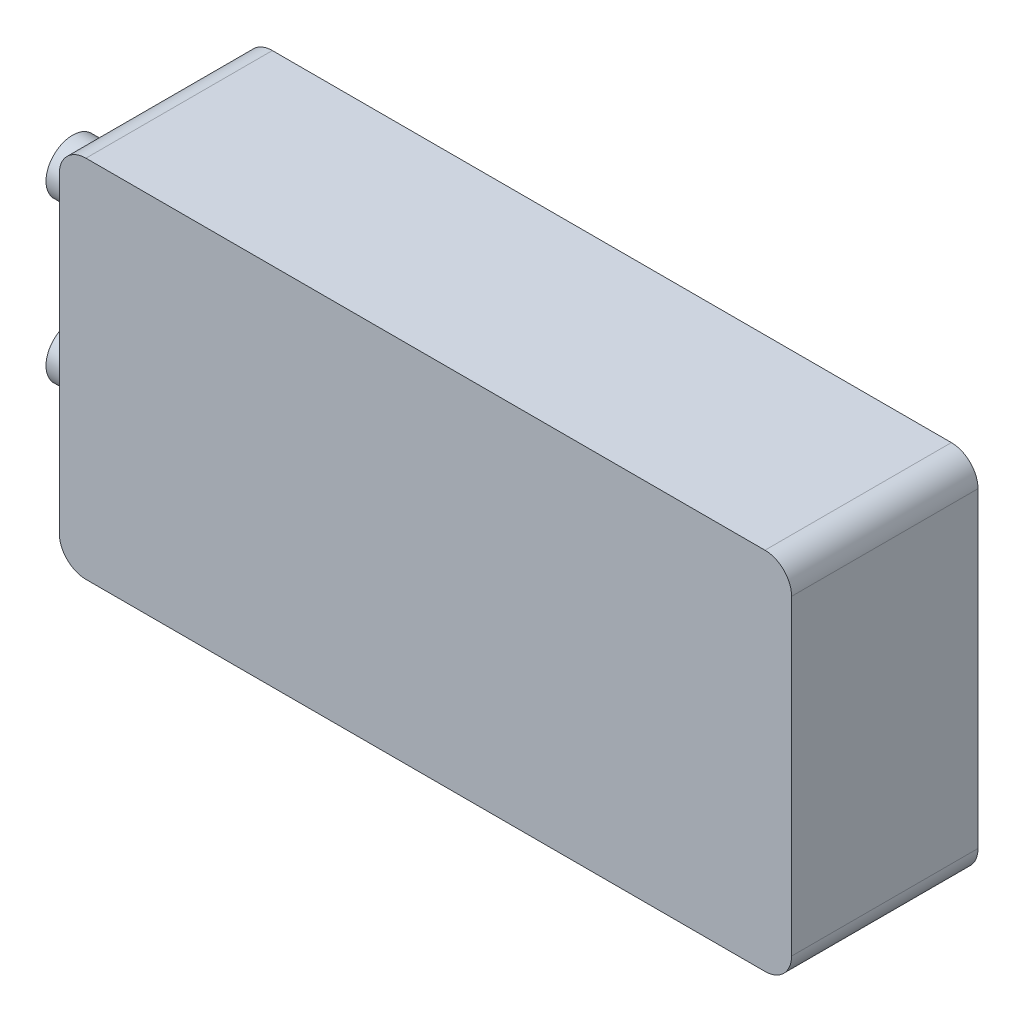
ISO-10303-21;
HEADER;
FILE_DESCRIPTION(('STEP AP214'),'2;1');
FILE_NAME('part.step','',(''),(''),'','','');
FILE_SCHEMA(('AUTOMOTIVE_DESIGN { 1 0 10303 214 1 1 1 1 }'));
ENDSEC;
DATA;
#1=APPLICATION_CONTEXT('core data for automotive mechanical design processes');
#2=APPLICATION_PROTOCOL_DEFINITION('international standard','automotive_design',2000,#1);
#3=PRODUCT_CONTEXT('',#1,'mechanical');
#4=PRODUCT('Part','Part','',(#3));
#5=PRODUCT_RELATED_PRODUCT_CATEGORY('part','',(#4));
#6=PRODUCT_DEFINITION_FORMATION('','',#4);
#7=PRODUCT_DEFINITION_CONTEXT('part definition',#1,'design');
#8=PRODUCT_DEFINITION('design','',#6,#7);
#9=PRODUCT_DEFINITION_SHAPE('','',#8);
#10=(LENGTH_UNIT() NAMED_UNIT(*) SI_UNIT(.MILLI.,.METRE.));
#11=(NAMED_UNIT(*) PLANE_ANGLE_UNIT() SI_UNIT($,.RADIAN.));
#12=(NAMED_UNIT(*) SI_UNIT($,.STERADIAN.) SOLID_ANGLE_UNIT());
#13=UNCERTAINTY_MEASURE_WITH_UNIT(LENGTH_MEASURE(1.E-05),#10,'distance_accuracy_value','');
#14=(GEOMETRIC_REPRESENTATION_CONTEXT(3) GLOBAL_UNCERTAINTY_ASSIGNED_CONTEXT((#13)) GLOBAL_UNIT_ASSIGNED_CONTEXT((#10,
#11,#12)) REPRESENTATION_CONTEXT('',''));
#15=CARTESIAN_POINT('',(0.,0.,0.));
#16=DIRECTION('',(0.,0.,1.));
#17=DIRECTION('',(1.,0.,0.));
#18=AXIS2_PLACEMENT_3D('',#15,#16,#17);
#19=CARTESIAN_POINT('',(34.925,17.399,17.78));
#20=DIRECTION('',(-1.,0.,0.));
#21=DIRECTION('',(0.,0.,1.));
#22=AXIS2_PLACEMENT_3D('',#19,#20,#21);
#23=PLANE('',#22);
#24=DIRECTION('',(0.,1.,0.));
#25=VECTOR('',#24,1.);
#26=CARTESIAN_POINT('',(34.925,17.399,17.78));
#27=LINE('',#26,#25);
#28=CARTESIAN_POINT('',(34.925,-14.859,17.78));
#29=VERTEX_POINT('',#28);
#30=CARTESIAN_POINT('',(34.925,14.859,17.78));
#31=VERTEX_POINT('',#30);
#32=EDGE_CURVE('E131',#29,#31,#27,.T.);
#33=ORIENTED_EDGE('',*,*,#32,.F.);
#34=DIRECTION('',(0.,0.,-1.));
#35=VECTOR('',#34,1.);
#36=CARTESIAN_POINT('',(34.925,-14.859,17.78));
#37=LINE('',#36,#35);
#38=CARTESIAN_POINT('',(34.925,-14.859,0.));
#39=VERTEX_POINT('',#38);
#40=EDGE_CURVE('E115',#29,#39,#37,.T.);
#41=ORIENTED_EDGE('',*,*,#40,.T.);
#42=DIRECTION('',(0.,1.,0.));
#43=VECTOR('',#42,1.);
#44=CARTESIAN_POINT('',(34.925,17.399,0.));
#45=LINE('',#44,#43);
#46=CARTESIAN_POINT('',(34.925,14.859,0.));
#47=VERTEX_POINT('',#46);
#48=EDGE_CURVE('E128',#39,#47,#45,.T.);
#49=ORIENTED_EDGE('',*,*,#48,.T.);
#50=DIRECTION('',(0.,0.,-1.));
#51=VECTOR('',#50,1.);
#52=CARTESIAN_POINT('',(34.925,14.859,17.78));
#53=LINE('',#52,#51);
#54=EDGE_CURVE('E134',#47,#31,#53,.F.);
#55=ORIENTED_EDGE('',*,*,#54,.T.);
#56=EDGE_LOOP('',(#33,#41,#49,#55));
#57=FACE_BOUND('',#56,.T.);
#58=ADVANCED_FACE('F43',(#57),#23,.F.);
#59=CARTESIAN_POINT('',(-34.925,17.399,17.78));
#60=DIRECTION('',(0.,-1.,0.));
#61=DIRECTION('',(0.,0.,-1.));
#62=AXIS2_PLACEMENT_3D('',#59,#60,#61);
#63=PLANE('',#62);
#64=DIRECTION('',(-1.,0.,0.));
#65=VECTOR('',#64,1.);
#66=CARTESIAN_POINT('',(-34.925,17.399,17.78));
#67=LINE('',#66,#65);
#68=CARTESIAN_POINT('',(32.385,17.399,17.78));
#69=VERTEX_POINT('',#68);
#70=CARTESIAN_POINT('',(-32.385,17.399,17.78));
#71=VERTEX_POINT('',#70);
#72=EDGE_CURVE('E221',#69,#71,#67,.T.);
#73=ORIENTED_EDGE('',*,*,#72,.F.);
#74=DIRECTION('',(0.,0.,-1.));
#75=VECTOR('',#74,1.);
#76=CARTESIAN_POINT('',(32.385,17.399,17.78));
#77=LINE('',#76,#75);
#78=CARTESIAN_POINT('',(32.385,17.399,0.));
#79=VERTEX_POINT('',#78);
#80=EDGE_CURVE('E187',#69,#79,#77,.T.);
#81=ORIENTED_EDGE('',*,*,#80,.T.);
#82=DIRECTION('',(-1.,0.,0.));
#83=VECTOR('',#82,1.);
#84=CARTESIAN_POINT('',(-34.925,17.399,0.));
#85=LINE('',#84,#83);
#86=CARTESIAN_POINT('',(-32.385,17.399,0.));
#87=VERTEX_POINT('',#86);
#88=EDGE_CURVE('E139',#79,#87,#85,.T.);
#89=ORIENTED_EDGE('',*,*,#88,.T.);
#90=DIRECTION('',(0.,0.,-1.));
#91=VECTOR('',#90,1.);
#92=CARTESIAN_POINT('',(-32.385,17.399,17.78));
#93=LINE('',#92,#91);
#94=EDGE_CURVE('E184',#87,#71,#93,.F.);
#95=ORIENTED_EDGE('',*,*,#94,.T.);
#96=EDGE_LOOP('',(#73,#81,#89,#95));
#97=FACE_BOUND('',#96,.T.);
#98=ADVANCED_FACE('F205',(#97),#63,.F.);
#99=CARTESIAN_POINT('',(-34.925,17.399,17.78));
#100=DIRECTION('',(1.,0.,0.));
#101=DIRECTION('',(0.,0.,-1.));
#102=AXIS2_PLACEMENT_3D('',#99,#100,#101);
#103=PLANE('',#102);
#104=CARTESIAN_POINT('',(-34.925,-8.001,8.89));
#105=DIRECTION('',(1.,0.,0.));
#106=DIRECTION('',(0.,0.,-1.));
#107=AXIS2_PLACEMENT_3D('',#104,#105,#106);
#108=CIRCLE('',#107,2.54);
#109=CARTESIAN_POINT('',(-34.925,-8.001,6.35));
#110=VERTEX_POINT('',#109);
#111=EDGE_CURVE('E11',#110,#110,#108,.F.);
#112=ORIENTED_EDGE('',*,*,#111,.F.);
#113=EDGE_LOOP('',(#112));
#114=FACE_BOUND('',#113,.T.);
#115=CARTESIAN_POINT('',(-34.925,7.239,8.89));
#116=DIRECTION('',(1.,0.,0.));
#117=DIRECTION('',(0.,0.,-1.));
#118=AXIS2_PLACEMENT_3D('',#115,#116,#117);
#119=CIRCLE('',#118,2.54);
#120=CARTESIAN_POINT('',(-34.925,7.239,6.35));
#121=VERTEX_POINT('',#120);
#122=EDGE_CURVE('E52',#121,#121,#119,.F.);
#123=ORIENTED_EDGE('',*,*,#122,.F.);
#124=EDGE_LOOP('',(#123));
#125=FACE_BOUND('',#124,.T.);
#126=DIRECTION('',(0.,-1.,0.));
#127=VECTOR('',#126,1.);
#128=CARTESIAN_POINT('',(-34.925,17.399,0.));
#129=LINE('',#128,#127);
#130=CARTESIAN_POINT('',(-34.925,14.859,0.));
#131=VERTEX_POINT('',#130);
#132=CARTESIAN_POINT('',(-34.925,-14.859,0.));
#133=VERTEX_POINT('',#132);
#134=EDGE_CURVE('E145',#131,#133,#129,.T.);
#135=ORIENTED_EDGE('',*,*,#134,.T.);
#136=DIRECTION('',(0.,0.,-1.));
#137=VECTOR('',#136,1.);
#138=CARTESIAN_POINT('',(-34.925,-14.859,17.78));
#139=LINE('',#138,#137);
#140=CARTESIAN_POINT('',(-34.925,-14.859,17.78));
#141=VERTEX_POINT('',#140);
#142=EDGE_CURVE('E59',#133,#141,#139,.F.);
#143=ORIENTED_EDGE('',*,*,#142,.T.);
#144=DIRECTION('',(0.,-1.,0.));
#145=VECTOR('',#144,1.);
#146=CARTESIAN_POINT('',(-34.925,17.399,17.78));
#147=LINE('',#146,#145);
#148=CARTESIAN_POINT('',(-34.925,14.859,17.78));
#149=VERTEX_POINT('',#148);
#150=EDGE_CURVE('E217',#149,#141,#147,.T.);
#151=ORIENTED_EDGE('',*,*,#150,.F.);
#152=DIRECTION('',(0.,0.,-1.));
#153=VECTOR('',#152,1.);
#154=CARTESIAN_POINT('',(-34.925,14.859,17.78));
#155=LINE('',#154,#153);
#156=EDGE_CURVE('E191',#149,#131,#155,.T.);
#157=ORIENTED_EDGE('',*,*,#156,.T.);
#158=EDGE_LOOP('',(#135,#143,#151,#157));
#159=FACE_BOUND('',#158,.T.);
#160=ADVANCED_FACE('F202',(#114,#125,#159),#103,.F.);
#161=CARTESIAN_POINT('',(-34.925,-17.399,17.78));
#162=DIRECTION('',(0.,1.,0.));
#163=DIRECTION('',(0.,0.,1.));
#164=AXIS2_PLACEMENT_3D('',#161,#162,#163);
#165=PLANE('',#164);
#166=DIRECTION('',(1.,0.,0.));
#167=VECTOR('',#166,1.);
#168=CARTESIAN_POINT('',(-34.925,-17.399,0.));
#169=LINE('',#168,#167);
#170=CARTESIAN_POINT('',(-32.385,-17.399,0.));
#171=VERTEX_POINT('',#170);
#172=CARTESIAN_POINT('',(32.385,-17.399,0.));
#173=VERTEX_POINT('',#172);
#174=EDGE_CURVE('E156',#171,#173,#169,.T.);
#175=ORIENTED_EDGE('',*,*,#174,.T.);
#176=DIRECTION('',(0.,0.,-1.));
#177=VECTOR('',#176,1.);
#178=CARTESIAN_POINT('',(32.385,-17.399,17.78));
#179=LINE('',#178,#177);
#180=CARTESIAN_POINT('',(32.385,-17.399,17.78));
#181=VERTEX_POINT('',#180);
#182=EDGE_CURVE('E116',#173,#181,#179,.F.);
#183=ORIENTED_EDGE('',*,*,#182,.T.);
#184=DIRECTION('',(1.,0.,0.));
#185=VECTOR('',#184,1.);
#186=CARTESIAN_POINT('',(-34.925,-17.399,17.78));
#187=LINE('',#186,#185);
#188=CARTESIAN_POINT('',(-32.385,-17.399,17.78));
#189=VERTEX_POINT('',#188);
#190=EDGE_CURVE('E151',#189,#181,#187,.T.);
#191=ORIENTED_EDGE('',*,*,#190,.F.);
#192=DIRECTION('',(0.,0.,-1.));
#193=VECTOR('',#192,1.);
#194=CARTESIAN_POINT('',(-32.385,-17.399,17.78));
#195=LINE('',#194,#193);
#196=EDGE_CURVE('E122',#189,#171,#195,.T.);
#197=ORIENTED_EDGE('',*,*,#196,.T.);
#198=EDGE_LOOP('',(#175,#183,#191,#197));
#199=FACE_BOUND('',#198,.T.);
#200=ADVANCED_FACE('F204',(#199),#165,.F.);
#201=CARTESIAN_POINT('',(0.,0.,17.78));
#202=DIRECTION('',(0.,0.,1.));
#203=DIRECTION('',(1.,0.,0.));
#204=AXIS2_PLACEMENT_3D('',#201,#202,#203);
#205=PLANE('',#204);
#206=ORIENTED_EDGE('',*,*,#190,.T.);
#207=CARTESIAN_POINT('',(32.385,-14.859,17.78));
#208=DIRECTION('',(0.,0.,1.));
#209=DIRECTION('',(1.,0.,0.));
#210=AXIS2_PLACEMENT_3D('',#207,#208,#209);
#211=CIRCLE('',#210,2.54);
#212=EDGE_CURVE('E181',#181,#29,#211,.T.);
#213=ORIENTED_EDGE('',*,*,#212,.T.);
#214=ORIENTED_EDGE('',*,*,#32,.T.);
#215=CARTESIAN_POINT('',(32.385,14.859,17.78));
#216=DIRECTION('',(0.,0.,1.));
#217=DIRECTION('',(1.,0.,0.));
#218=AXIS2_PLACEMENT_3D('',#215,#216,#217);
#219=CIRCLE('',#218,2.54);
#220=EDGE_CURVE('E178',#31,#69,#219,.T.);
#221=ORIENTED_EDGE('',*,*,#220,.T.);
#222=ORIENTED_EDGE('',*,*,#72,.T.);
#223=CARTESIAN_POINT('',(-32.385,14.859,17.78));
#224=DIRECTION('',(0.,0.,1.));
#225=DIRECTION('',(1.,0.,0.));
#226=AXIS2_PLACEMENT_3D('',#223,#224,#225);
#227=CIRCLE('',#226,2.54);
#228=EDGE_CURVE('E66',#71,#149,#227,.T.);
#229=ORIENTED_EDGE('',*,*,#228,.T.);
#230=ORIENTED_EDGE('',*,*,#150,.T.);
#231=CARTESIAN_POINT('',(-32.385,-14.859,17.78));
#232=DIRECTION('',(0.,0.,1.));
#233=DIRECTION('',(1.,0.,0.));
#234=AXIS2_PLACEMENT_3D('',#231,#232,#233);
#235=CIRCLE('',#234,2.54);
#236=EDGE_CURVE('E175',#141,#189,#235,.T.);
#237=ORIENTED_EDGE('',*,*,#236,.T.);
#238=EDGE_LOOP('',(#206,#213,#214,#221,#222,#229,#230,#237));
#239=FACE_BOUND('',#238,.T.);
#240=ADVANCED_FACE('F216',(#239),#205,.T.);
#241=CARTESIAN_POINT('',(0.,0.,0.));
#242=DIRECTION('',(0.,0.,1.));
#243=DIRECTION('',(1.,0.,0.));
#244=AXIS2_PLACEMENT_3D('',#241,#242,#243);
#245=PLANE('',#244);
#246=ORIENTED_EDGE('',*,*,#48,.F.);
#247=CARTESIAN_POINT('',(32.385,-14.859,0.));
#248=DIRECTION('',(0.,0.,1.));
#249=DIRECTION('',(1.,0.,0.));
#250=AXIS2_PLACEMENT_3D('',#247,#248,#249);
#251=CIRCLE('',#250,2.54);
#252=EDGE_CURVE('E111',#39,#173,#251,.F.);
#253=ORIENTED_EDGE('',*,*,#252,.T.);
#254=ORIENTED_EDGE('',*,*,#174,.F.);
#255=CARTESIAN_POINT('',(-32.385,-14.859,0.));
#256=DIRECTION('',(0.,0.,1.));
#257=DIRECTION('',(1.,0.,0.));
#258=AXIS2_PLACEMENT_3D('',#255,#256,#257);
#259=CIRCLE('',#258,2.54);
#260=EDGE_CURVE('E163',#171,#133,#259,.F.);
#261=ORIENTED_EDGE('',*,*,#260,.T.);
#262=ORIENTED_EDGE('',*,*,#134,.F.);
#263=CARTESIAN_POINT('',(-32.385,14.859,0.));
#264=DIRECTION('',(0.,0.,1.));
#265=DIRECTION('',(1.,0.,0.));
#266=AXIS2_PLACEMENT_3D('',#263,#264,#265);
#267=CIRCLE('',#266,2.54);
#268=EDGE_CURVE('E133',#131,#87,#267,.F.);
#269=ORIENTED_EDGE('',*,*,#268,.T.);
#270=ORIENTED_EDGE('',*,*,#88,.F.);
#271=CARTESIAN_POINT('',(32.385,14.859,0.));
#272=DIRECTION('',(0.,0.,1.));
#273=DIRECTION('',(1.,0.,0.));
#274=AXIS2_PLACEMENT_3D('',#271,#272,#273);
#275=CIRCLE('',#274,2.54);
#276=EDGE_CURVE('E123',#79,#47,#275,.F.);
#277=ORIENTED_EDGE('',*,*,#276,.T.);
#278=EDGE_LOOP('',(#246,#253,#254,#261,#262,#269,#270,#277));
#279=FACE_BOUND('',#278,.T.);
#280=ADVANCED_FACE('F136',(#279),#245,.F.);
#281=CARTESIAN_POINT('',(32.385,-14.859,17.78));
#282=DIRECTION('',(0.,0.,-1.));
#283=DIRECTION('',(-1.,0.,0.));
#284=AXIS2_PLACEMENT_3D('',#281,#282,#283);
#285=CYLINDRICAL_SURFACE('',#284,2.54);
#286=ORIENTED_EDGE('',*,*,#212,.F.);
#287=ORIENTED_EDGE('',*,*,#182,.F.);
#288=ORIENTED_EDGE('',*,*,#252,.F.);
#289=ORIENTED_EDGE('',*,*,#40,.F.);
#290=EDGE_LOOP('',(#286,#287,#288,#289));
#291=FACE_BOUND('',#290,.T.);
#292=ADVANCED_FACE('F114',(#291),#285,.T.);
#293=CARTESIAN_POINT('',(32.385,14.859,17.78));
#294=DIRECTION('',(0.,0.,-1.));
#295=DIRECTION('',(-1.,0.,0.));
#296=AXIS2_PLACEMENT_3D('',#293,#294,#295);
#297=CYLINDRICAL_SURFACE('',#296,2.54);
#298=ORIENTED_EDGE('',*,*,#220,.F.);
#299=ORIENTED_EDGE('',*,*,#54,.F.);
#300=ORIENTED_EDGE('',*,*,#276,.F.);
#301=ORIENTED_EDGE('',*,*,#80,.F.);
#302=EDGE_LOOP('',(#298,#299,#300,#301));
#303=FACE_BOUND('',#302,.T.);
#304=ADVANCED_FACE('F256',(#303),#297,.T.);
#305=CARTESIAN_POINT('',(-32.385,-14.859,17.78));
#306=DIRECTION('',(0.,0.,-1.));
#307=DIRECTION('',(-1.,0.,0.));
#308=AXIS2_PLACEMENT_3D('',#305,#306,#307);
#309=CYLINDRICAL_SURFACE('',#308,2.54);
#310=ORIENTED_EDGE('',*,*,#236,.F.);
#311=ORIENTED_EDGE('',*,*,#142,.F.);
#312=ORIENTED_EDGE('',*,*,#260,.F.);
#313=ORIENTED_EDGE('',*,*,#196,.F.);
#314=EDGE_LOOP('',(#310,#311,#312,#313));
#315=FACE_BOUND('',#314,.T.);
#316=ADVANCED_FACE('F212',(#315),#309,.T.);
#317=CARTESIAN_POINT('',(-32.385,14.859,17.78));
#318=DIRECTION('',(0.,0.,-1.));
#319=DIRECTION('',(-1.,0.,0.));
#320=AXIS2_PLACEMENT_3D('',#317,#318,#319);
#321=CYLINDRICAL_SURFACE('',#320,2.54);
#322=ORIENTED_EDGE('',*,*,#228,.F.);
#323=ORIENTED_EDGE('',*,*,#94,.F.);
#324=ORIENTED_EDGE('',*,*,#268,.F.);
#325=ORIENTED_EDGE('',*,*,#156,.F.);
#326=EDGE_LOOP('',(#322,#323,#324,#325));
#327=FACE_BOUND('',#326,.T.);
#328=ADVANCED_FACE('F45',(#327),#321,.T.);
#329=CARTESIAN_POINT('',(-42.545,7.239,8.89));
#330=DIRECTION('',(1.,0.,0.));
#331=DIRECTION('',(0.,0.,-1.));
#332=AXIS2_PLACEMENT_3D('',#329,#330,#331);
#333=CYLINDRICAL_SURFACE('',#332,2.54);
#334=CARTESIAN_POINT('',(-42.545,7.239,8.89));
#335=DIRECTION('',(-1.,0.,0.));
#336=DIRECTION('',(0.,0.,1.));
#337=AXIS2_PLACEMENT_3D('',#334,#335,#336);
#338=CIRCLE('',#337,2.54);
#339=CARTESIAN_POINT('',(-42.545,7.239,11.43));
#340=VERTEX_POINT('',#339);
#341=EDGE_CURVE('E140',#340,#340,#338,.T.);
#342=ORIENTED_EDGE('',*,*,#341,.F.);
#343=EDGE_LOOP('',(#342));
#344=FACE_BOUND('',#343,.T.);
#345=ORIENTED_EDGE('',*,*,#122,.T.);
#346=EDGE_LOOP('',(#345));
#347=FACE_BOUND('',#346,.T.);
#348=ADVANCED_FACE('F200',(#344,#347),#333,.T.);
#349=CARTESIAN_POINT('',(-42.545,7.239,8.89));
#350=DIRECTION('',(-1.,0.,0.));
#351=DIRECTION('',(0.,0.,1.));
#352=AXIS2_PLACEMENT_3D('',#349,#350,#351);
#353=PLANE('',#352);
#354=ORIENTED_EDGE('',*,*,#341,.T.);
#355=EDGE_LOOP('',(#354));
#356=FACE_BOUND('',#355,.T.);
#357=ADVANCED_FACE('F236',(#356),#353,.T.);
#358=CARTESIAN_POINT('',(-42.545,-8.001,8.89));
#359=DIRECTION('',(1.,0.,0.));
#360=DIRECTION('',(0.,0.,-1.));
#361=AXIS2_PLACEMENT_3D('',#358,#359,#360);
#362=CYLINDRICAL_SURFACE('',#361,2.54);
#363=CARTESIAN_POINT('',(-42.545,-8.001,8.89));
#364=DIRECTION('',(-1.,0.,0.));
#365=DIRECTION('',(0.,0.,1.));
#366=AXIS2_PLACEMENT_3D('',#363,#364,#365);
#367=CIRCLE('',#366,2.54);
#368=CARTESIAN_POINT('',(-42.545,-8.001,11.43));
#369=VERTEX_POINT('',#368);
#370=EDGE_CURVE('E148',#369,#369,#367,.T.);
#371=ORIENTED_EDGE('',*,*,#370,.F.);
#372=EDGE_LOOP('',(#371));
#373=FACE_BOUND('',#372,.T.);
#374=ORIENTED_EDGE('',*,*,#111,.T.);
#375=EDGE_LOOP('',(#374));
#376=FACE_BOUND('',#375,.T.);
#377=ADVANCED_FACE('F233',(#373,#376),#362,.T.);
#378=CARTESIAN_POINT('',(-42.545,-8.001,8.89));
#379=DIRECTION('',(-1.,0.,0.));
#380=DIRECTION('',(0.,0.,1.));
#381=AXIS2_PLACEMENT_3D('',#378,#379,#380);
#382=PLANE('',#381);
#383=ORIENTED_EDGE('',*,*,#370,.T.);
#384=EDGE_LOOP('',(#383));
#385=FACE_BOUND('',#384,.T.);
#386=ADVANCED_FACE('F231',(#385),#382,.T.);
#387=CLOSED_SHELL('',(#58,#98,#160,#200,#240,#280,#292,#304,#316,#328,#348,#357,#377,#386));
#388=MANIFOLD_SOLID_BREP('B2',#387);
#389=ADVANCED_BREP_SHAPE_REPRESENTATION('',(#18,#388),#14);
#390=SHAPE_DEFINITION_REPRESENTATION(#9,#389);
ENDSEC;
END-ISO-10303-21;
